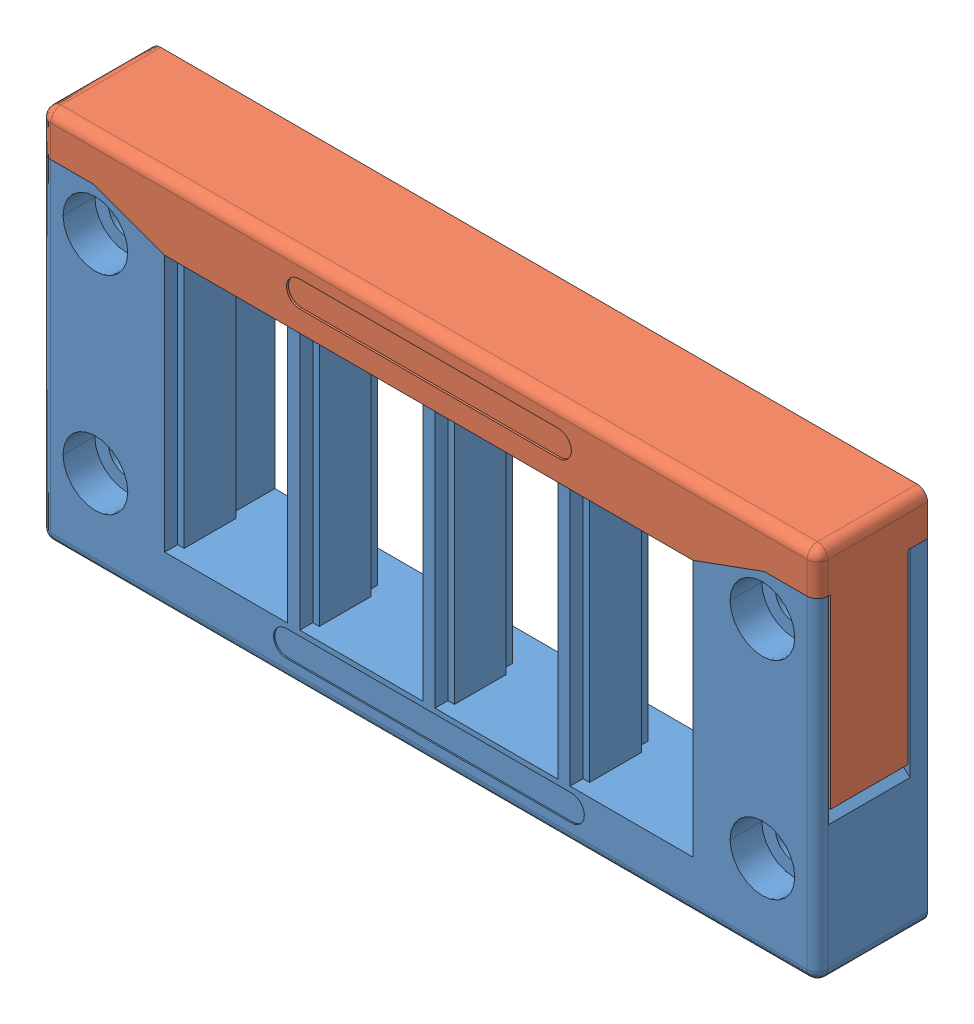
SolidWorks assembly 42418.SLDASM, configuration Default (file format 8000). Lengths in mm.
Overall size (120 58 17).
2 component instances, 2 part files, 0 mates.
Components (placement in the parent):
- 42418_01-1: 42418_01.SLDPRT [Default] at origin size (120 51.5 17)
- 42418_02-1: 42418_02.SLDPRT [Default] at origin size (120 35.2 17)
